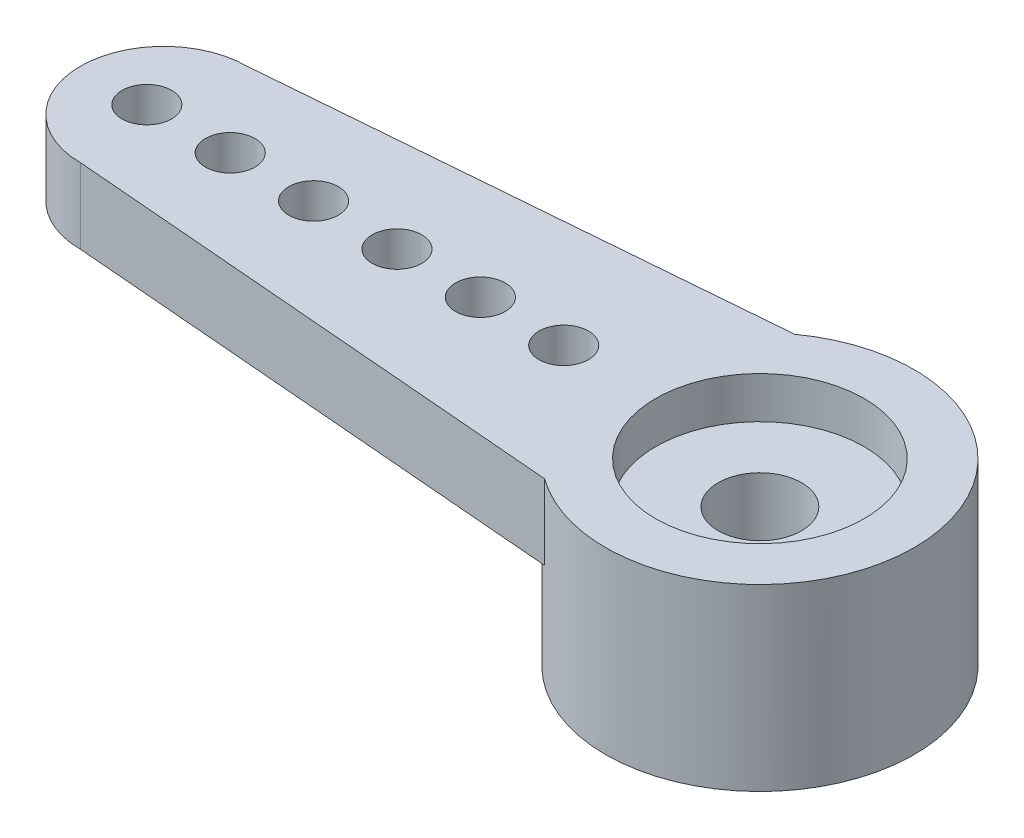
ISO-10303-21;
HEADER;
FILE_DESCRIPTION(('STEP AP214'),'2;1');
FILE_NAME('part.step','',(''),(''),'','','');
FILE_SCHEMA(('AUTOMOTIVE_DESIGN { 1 0 10303 214 1 1 1 1 }'));
ENDSEC;
DATA;
#1=APPLICATION_CONTEXT('core data for automotive mechanical design processes');
#2=APPLICATION_PROTOCOL_DEFINITION('international standard','automotive_design',2000,#1);
#3=PRODUCT_CONTEXT('',#1,'mechanical');
#4=PRODUCT('Part','Part','',(#3));
#5=PRODUCT_RELATED_PRODUCT_CATEGORY('part','',(#4));
#6=PRODUCT_DEFINITION_FORMATION('','',#4);
#7=PRODUCT_DEFINITION_CONTEXT('part definition',#1,'design');
#8=PRODUCT_DEFINITION('design','',#6,#7);
#9=PRODUCT_DEFINITION_SHAPE('','',#8);
#10=(LENGTH_UNIT() NAMED_UNIT(*) SI_UNIT(.MILLI.,.METRE.));
#11=(NAMED_UNIT(*) PLANE_ANGLE_UNIT() SI_UNIT($,.RADIAN.));
#12=(NAMED_UNIT(*) SI_UNIT($,.STERADIAN.) SOLID_ANGLE_UNIT());
#13=UNCERTAINTY_MEASURE_WITH_UNIT(LENGTH_MEASURE(1.E-05),#10,'distance_accuracy_value','');
#14=(GEOMETRIC_REPRESENTATION_CONTEXT(3) GLOBAL_UNCERTAINTY_ASSIGNED_CONTEXT((#13)) GLOBAL_UNIT_ASSIGNED_CONTEXT((#10,
#11,#12)) REPRESENTATION_CONTEXT('',''));
#15=CARTESIAN_POINT('',(0.,0.,0.));
#16=DIRECTION('',(0.,0.,1.));
#17=DIRECTION('',(1.,0.,0.));
#18=AXIS2_PLACEMENT_3D('',#15,#16,#17);
#19=CARTESIAN_POINT('',(0.,4.3,0.));
#20=DIRECTION('',(0.,-1.,0.));
#21=DIRECTION('',(0.,0.,-1.));
#22=AXIS2_PLACEMENT_3D('',#19,#20,#21);
#23=CYLINDRICAL_SURFACE('',#22,3.7);
#24=CARTESIAN_POINT('',(0.,2.5,0.));
#25=DIRECTION('',(0.,1.,0.));
#26=DIRECTION('',(0.,0.,1.));
#27=AXIS2_PLACEMENT_3D('',#24,#25,#26);
#28=CIRCLE('',#27,3.7);
#29=CARTESIAN_POINT('',(-2.16564,2.5,-3.00000056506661));
#30=VERTEX_POINT('',#29);
#31=CARTESIAN_POINT('',(-2.16564,2.5,3.00000056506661));
#32=VERTEX_POINT('',#31);
#33=EDGE_CURVE('E11',#30,#32,#28,.T.);
#34=ORIENTED_EDGE('',*,*,#33,.F.);
#35=DIRECTION('',(0.,1.,0.));
#36=VECTOR('',#35,1.);
#37=CARTESIAN_POINT('',(-2.16564,2.5,-3.00000056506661));
#38=LINE('',#37,#36);
#39=CARTESIAN_POINT('',(-2.16564,4.3,-3.00000056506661));
#40=VERTEX_POINT('',#39);
#41=EDGE_CURVE('E56',#30,#40,#38,.T.);
#42=ORIENTED_EDGE('',*,*,#41,.T.);
#43=CARTESIAN_POINT('',(0.,4.3,0.));
#44=DIRECTION('',(0.,1.,0.));
#45=DIRECTION('',(0.,0.,1.));
#46=AXIS2_PLACEMENT_3D('',#43,#44,#45);
#47=CIRCLE('',#46,3.7);
#48=CARTESIAN_POINT('',(-2.16564,4.3,3.00000056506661));
#49=VERTEX_POINT('',#48);
#50=EDGE_CURVE('E40',#49,#40,#47,.T.);
#51=ORIENTED_EDGE('',*,*,#50,.F.);
#52=DIRECTION('',(0.,1.,0.));
#53=VECTOR('',#52,1.);
#54=CARTESIAN_POINT('',(-2.16564,2.5,3.00000056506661));
#55=LINE('',#54,#53);
#56=EDGE_CURVE('E86',#32,#49,#55,.T.);
#57=ORIENTED_EDGE('',*,*,#56,.F.);
#58=EDGE_LOOP('',(#34,#42,#51,#57));
#59=FACE_BOUND('',#58,.T.);
#60=CARTESIAN_POINT('',(0.,0.,0.));
#61=DIRECTION('',(0.,1.,0.));
#62=DIRECTION('',(0.,0.,1.));
#63=AXIS2_PLACEMENT_3D('',#60,#61,#62);
#64=CIRCLE('',#63,3.7);
#65=CARTESIAN_POINT('',(0.,0.,3.7));
#66=VERTEX_POINT('',#65);
#67=EDGE_CURVE('E123',#66,#66,#64,.T.);
#68=ORIENTED_EDGE('',*,*,#67,.T.);
#69=EDGE_LOOP('',(#68));
#70=FACE_BOUND('',#69,.T.);
#71=ADVANCED_FACE('F33',(#59,#70),#23,.T.);
#72=CARTESIAN_POINT('',(0.,4.3,0.));
#73=DIRECTION('',(0.,1.,0.));
#74=DIRECTION('',(0.,0.,1.));
#75=AXIS2_PLACEMENT_3D('',#72,#73,#74);
#76=PLANE('',#75);
#77=CARTESIAN_POINT('',(-12.705,4.3,0.));
#78=DIRECTION('',(0.,1.,0.));
#79=DIRECTION('',(0.,0.,1.));
#80=AXIS2_PLACEMENT_3D('',#77,#78,#79);
#81=CIRCLE('',#80,0.595);
#82=CARTESIAN_POINT('',(-12.705,4.3,0.595000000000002));
#83=VERTEX_POINT('',#82);
#84=EDGE_CURVE('E213',#83,#83,#81,.T.);
#85=ORIENTED_EDGE('',*,*,#84,.F.);
#86=EDGE_LOOP('',(#85));
#87=FACE_BOUND('',#86,.T.);
#88=CARTESIAN_POINT('',(-10.705,4.3,0.));
#89=DIRECTION('',(0.,1.,0.));
#90=DIRECTION('',(0.,0.,1.));
#91=AXIS2_PLACEMENT_3D('',#88,#89,#90);
#92=CIRCLE('',#91,0.595);
#93=CARTESIAN_POINT('',(-10.705,4.3,0.595000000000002));
#94=VERTEX_POINT('',#93);
#95=EDGE_CURVE('E219',#94,#94,#92,.T.);
#96=ORIENTED_EDGE('',*,*,#95,.F.);
#97=EDGE_LOOP('',(#96));
#98=FACE_BOUND('',#97,.T.);
#99=CARTESIAN_POINT('',(-8.705,4.3,0.));
#100=DIRECTION('',(0.,1.,0.));
#101=DIRECTION('',(0.,0.,1.));
#102=AXIS2_PLACEMENT_3D('',#99,#100,#101);
#103=CIRCLE('',#102,0.595);
#104=CARTESIAN_POINT('',(-8.705,4.3,0.595000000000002));
#105=VERTEX_POINT('',#104);
#106=EDGE_CURVE('E227',#105,#105,#103,.T.);
#107=ORIENTED_EDGE('',*,*,#106,.F.);
#108=EDGE_LOOP('',(#107));
#109=FACE_BOUND('',#108,.T.);
#110=CARTESIAN_POINT('',(-6.705,4.3,0.));
#111=DIRECTION('',(0.,1.,0.));
#112=DIRECTION('',(0.,0.,1.));
#113=AXIS2_PLACEMENT_3D('',#110,#111,#112);
#114=CIRCLE('',#113,0.595);
#115=CARTESIAN_POINT('',(-6.705,4.3,0.595000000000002));
#116=VERTEX_POINT('',#115);
#117=EDGE_CURVE('E233',#116,#116,#114,.T.);
#118=ORIENTED_EDGE('',*,*,#117,.F.);
#119=EDGE_LOOP('',(#118));
#120=FACE_BOUND('',#119,.T.);
#121=CARTESIAN_POINT('',(-4.705,4.3,0.));
#122=DIRECTION('',(0.,1.,0.));
#123=DIRECTION('',(0.,0.,1.));
#124=AXIS2_PLACEMENT_3D('',#121,#122,#123);
#125=CIRCLE('',#124,0.595);
#126=CARTESIAN_POINT('',(-4.705,4.3,0.595000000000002));
#127=VERTEX_POINT('',#126);
#128=EDGE_CURVE('E239',#127,#127,#125,.T.);
#129=ORIENTED_EDGE('',*,*,#128,.F.);
#130=EDGE_LOOP('',(#129));
#131=FACE_BOUND('',#130,.T.);
#132=CARTESIAN_POINT('',(-14.705,4.3,0.));
#133=DIRECTION('',(0.,1.,0.));
#134=DIRECTION('',(0.,0.,1.));
#135=AXIS2_PLACEMENT_3D('',#132,#133,#134);
#136=CIRCLE('',#135,0.595);
#137=CARTESIAN_POINT('',(-14.705,4.3,0.595000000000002));
#138=VERTEX_POINT('',#137);
#139=EDGE_CURVE('E216',#138,#138,#136,.T.);
#140=ORIENTED_EDGE('',*,*,#139,.F.);
#141=EDGE_LOOP('',(#140));
#142=FACE_BOUND('',#141,.T.);
#143=ORIENTED_EDGE('',*,*,#50,.T.);
#144=DIRECTION('',(-0.996621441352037,0.,0.0821322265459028));
#145=VECTOR('',#144,1.);
#146=CARTESIAN_POINT('',(-2.16564,4.3,-3.00000056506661));
#147=LINE('',#146,#145);
#148=CARTESIAN_POINT('',(-14.3,4.3,-2.));
#149=VERTEX_POINT('',#148);
#150=EDGE_CURVE('E70',#40,#149,#147,.T.);
#151=ORIENTED_EDGE('',*,*,#150,.T.);
#152=CARTESIAN_POINT('',(-14.3,4.3,0.));
#153=DIRECTION('',(0.,1.,0.));
#154=DIRECTION('',(0.,0.,1.));
#155=AXIS2_PLACEMENT_3D('',#152,#153,#154);
#156=CIRCLE('',#155,2.);
#157=CARTESIAN_POINT('',(-14.3,4.3,2.));
#158=VERTEX_POINT('',#157);
#159=EDGE_CURVE('E100',#149,#158,#156,.T.);
#160=ORIENTED_EDGE('',*,*,#159,.T.);
#161=DIRECTION('',(0.996621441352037,0.,0.0821322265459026));
#162=VECTOR('',#161,1.);
#163=CARTESIAN_POINT('',(-2.16564,4.3,3.00000056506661));
#164=LINE('',#163,#162);
#165=EDGE_CURVE('E47',#158,#49,#164,.T.);
#166=ORIENTED_EDGE('',*,*,#165,.T.);
#167=EDGE_LOOP('',(#143,#151,#160,#166));
#168=FACE_BOUND('',#167,.T.);
#169=CARTESIAN_POINT('',(0.,4.3,0.));
#170=DIRECTION('',(0.,1.,0.));
#171=DIRECTION('',(0.,0.,1.));
#172=AXIS2_PLACEMENT_3D('',#169,#170,#171);
#173=CIRCLE('',#172,2.5);
#174=CARTESIAN_POINT('',(0.,4.3,2.5));
#175=VERTEX_POINT('',#174);
#176=EDGE_CURVE('E111',#175,#175,#173,.T.);
#177=ORIENTED_EDGE('',*,*,#176,.F.);
#178=EDGE_LOOP('',(#177));
#179=FACE_BOUND('',#178,.T.);
#180=ADVANCED_FACE('F133',(#87,#98,#109,#120,#131,#142,#168,#179),#76,.T.);
#181=CARTESIAN_POINT('',(0.,0.,0.));
#182=DIRECTION('',(0.,1.,0.));
#183=DIRECTION('',(0.,0.,1.));
#184=AXIS2_PLACEMENT_3D('',#181,#182,#183);
#185=PLANE('',#184);
#186=CARTESIAN_POINT('',(0.,0.,0.));
#187=DIRECTION('',(0.,-1.,0.));
#188=DIRECTION('',(0.,0.,-1.));
#189=AXIS2_PLACEMENT_3D('',#186,#187,#188);
#190=CIRCLE('',#189,2.5);
#191=CARTESIAN_POINT('',(0.,0.,-2.5));
#192=VERTEX_POINT('',#191);
#193=EDGE_CURVE('E117',#192,#192,#190,.T.);
#194=ORIENTED_EDGE('',*,*,#193,.F.);
#195=EDGE_LOOP('',(#194));
#196=FACE_BOUND('',#195,.T.);
#197=ORIENTED_EDGE('',*,*,#67,.F.);
#198=EDGE_LOOP('',(#197));
#199=FACE_BOUND('',#198,.T.);
#200=ADVANCED_FACE('F130',(#196,#199),#185,.F.);
#201=CARTESIAN_POINT('',(0.,1.5,0.));
#202=DIRECTION('',(0.,-1.,0.));
#203=DIRECTION('',(0.,0.,-1.));
#204=AXIS2_PLACEMENT_3D('',#201,#202,#203);
#205=CYLINDRICAL_SURFACE('',#204,2.5);
#206=CARTESIAN_POINT('',(0.,1.5,0.));
#207=DIRECTION('',(0.,-1.,0.));
#208=DIRECTION('',(0.,0.,-1.));
#209=AXIS2_PLACEMENT_3D('',#206,#207,#208);
#210=CIRCLE('',#209,2.5);
#211=CARTESIAN_POINT('',(0.,1.5,-2.5));
#212=VERTEX_POINT('',#211);
#213=EDGE_CURVE('E120',#212,#212,#210,.T.);
#214=ORIENTED_EDGE('',*,*,#213,.F.);
#215=EDGE_LOOP('',(#214));
#216=FACE_BOUND('',#215,.T.);
#217=ORIENTED_EDGE('',*,*,#193,.T.);
#218=EDGE_LOOP('',(#217));
#219=FACE_BOUND('',#218,.T.);
#220=ADVANCED_FACE('F132',(#216,#219),#205,.F.);
#221=CARTESIAN_POINT('',(0.,1.5,0.));
#222=DIRECTION('',(0.,-1.,0.));
#223=DIRECTION('',(0.,0.,-1.));
#224=AXIS2_PLACEMENT_3D('',#221,#222,#223);
#225=PLANE('',#224);
#226=CARTESIAN_POINT('',(0.,1.5,0.));
#227=DIRECTION('',(0.,1.,0.));
#228=DIRECTION('',(0.,0.,1.));
#229=AXIS2_PLACEMENT_3D('',#226,#227,#228);
#230=CIRCLE('',#229,1.);
#231=CARTESIAN_POINT('',(0.,1.5,1.));
#232=VERTEX_POINT('',#231);
#233=EDGE_CURVE('E108',#232,#232,#230,.T.);
#234=ORIENTED_EDGE('',*,*,#233,.T.);
#235=EDGE_LOOP('',(#234));
#236=FACE_BOUND('',#235,.T.);
#237=ORIENTED_EDGE('',*,*,#213,.T.);
#238=EDGE_LOOP('',(#237));
#239=FACE_BOUND('',#238,.T.);
#240=ADVANCED_FACE('F139',(#236,#239),#225,.T.);
#241=CARTESIAN_POINT('',(0.,3.3,0.));
#242=DIRECTION('',(0.,1.,0.));
#243=DIRECTION('',(0.,0.,1.));
#244=AXIS2_PLACEMENT_3D('',#241,#242,#243);
#245=CYLINDRICAL_SURFACE('',#244,2.5);
#246=CARTESIAN_POINT('',(0.,3.3,0.));
#247=DIRECTION('',(0.,1.,0.));
#248=DIRECTION('',(0.,0.,1.));
#249=AXIS2_PLACEMENT_3D('',#246,#247,#248);
#250=CIRCLE('',#249,2.5);
#251=CARTESIAN_POINT('',(0.,3.3,2.5));
#252=VERTEX_POINT('',#251);
#253=EDGE_CURVE('E114',#252,#252,#250,.T.);
#254=ORIENTED_EDGE('',*,*,#253,.F.);
#255=EDGE_LOOP('',(#254));
#256=FACE_BOUND('',#255,.T.);
#257=ORIENTED_EDGE('',*,*,#176,.T.);
#258=EDGE_LOOP('',(#257));
#259=FACE_BOUND('',#258,.T.);
#260=ADVANCED_FACE('F153',(#256,#259),#245,.F.);
#261=CARTESIAN_POINT('',(0.,3.3,0.));
#262=DIRECTION('',(0.,1.,0.));
#263=DIRECTION('',(0.,0.,1.));
#264=AXIS2_PLACEMENT_3D('',#261,#262,#263);
#265=PLANE('',#264);
#266=CARTESIAN_POINT('',(0.,3.3,0.));
#267=DIRECTION('',(0.,1.,0.));
#268=DIRECTION('',(0.,0.,1.));
#269=AXIS2_PLACEMENT_3D('',#266,#267,#268);
#270=CIRCLE('',#269,1.);
#271=CARTESIAN_POINT('',(0.,3.3,1.));
#272=VERTEX_POINT('',#271);
#273=EDGE_CURVE('E105',#272,#272,#270,.T.);
#274=ORIENTED_EDGE('',*,*,#273,.F.);
#275=EDGE_LOOP('',(#274));
#276=FACE_BOUND('',#275,.T.);
#277=ORIENTED_EDGE('',*,*,#253,.T.);
#278=EDGE_LOOP('',(#277));
#279=FACE_BOUND('',#278,.T.);
#280=ADVANCED_FACE('F155',(#276,#279),#265,.T.);
#281=CARTESIAN_POINT('',(0.,1.5,0.));
#282=DIRECTION('',(0.,1.,0.));
#283=DIRECTION('',(0.,0.,1.));
#284=AXIS2_PLACEMENT_3D('',#281,#282,#283);
#285=CYLINDRICAL_SURFACE('',#284,1.);
#286=ORIENTED_EDGE('',*,*,#233,.F.);
#287=EDGE_LOOP('',(#286));
#288=FACE_BOUND('',#287,.T.);
#289=ORIENTED_EDGE('',*,*,#273,.T.);
#290=EDGE_LOOP('',(#289));
#291=FACE_BOUND('',#290,.T.);
#292=ADVANCED_FACE('F162',(#288,#291),#285,.F.);
#293=CARTESIAN_POINT('',(-2.16564,2.5,-3.00000056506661));
#294=DIRECTION('',(-0.0821322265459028,0.,-0.996621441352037));
#295=DIRECTION('',(-0.996621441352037,0.,0.0821322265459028));
#296=AXIS2_PLACEMENT_3D('',#293,#294,#295);
#297=PLANE('',#296);
#298=ORIENTED_EDGE('',*,*,#150,.F.);
#299=ORIENTED_EDGE('',*,*,#41,.F.);
#300=DIRECTION('',(-0.996621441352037,0.,0.0821322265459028));
#301=VECTOR('',#300,1.);
#302=CARTESIAN_POINT('',(-2.16564,2.5,-3.00000056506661));
#303=LINE('',#302,#301);
#304=CARTESIAN_POINT('',(-14.3,2.5,-2.));
#305=VERTEX_POINT('',#304);
#306=EDGE_CURVE('E94',#30,#305,#303,.T.);
#307=ORIENTED_EDGE('',*,*,#306,.T.);
#308=DIRECTION('',(0.,1.,0.));
#309=VECTOR('',#308,1.);
#310=CARTESIAN_POINT('',(-14.3,2.5,-2.));
#311=LINE('',#310,#309);
#312=EDGE_CURVE('E76',#305,#149,#311,.T.);
#313=ORIENTED_EDGE('',*,*,#312,.T.);
#314=EDGE_LOOP('',(#298,#299,#307,#313));
#315=FACE_BOUND('',#314,.T.);
#316=ADVANCED_FACE('F171',(#315),#297,.T.);
#317=CARTESIAN_POINT('',(-2.16564,2.5,3.00000056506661));
#318=DIRECTION('',(-0.0821322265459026,0.,0.996621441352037));
#319=DIRECTION('',(0.996621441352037,0.,0.0821322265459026));
#320=AXIS2_PLACEMENT_3D('',#317,#318,#319);
#321=PLANE('',#320);
#322=ORIENTED_EDGE('',*,*,#165,.F.);
#323=DIRECTION('',(0.,1.,0.));
#324=VECTOR('',#323,1.);
#325=CARTESIAN_POINT('',(-14.3,2.5,2.));
#326=LINE('',#325,#324);
#327=CARTESIAN_POINT('',(-14.3,2.5,2.));
#328=VERTEX_POINT('',#327);
#329=EDGE_CURVE('E81',#328,#158,#326,.T.);
#330=ORIENTED_EDGE('',*,*,#329,.F.);
#331=DIRECTION('',(0.996621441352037,0.,0.0821322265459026));
#332=VECTOR('',#331,1.);
#333=CARTESIAN_POINT('',(-2.16564,2.5,3.00000056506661));
#334=LINE('',#333,#332);
#335=EDGE_CURVE('E84',#328,#32,#334,.T.);
#336=ORIENTED_EDGE('',*,*,#335,.T.);
#337=ORIENTED_EDGE('',*,*,#56,.T.);
#338=EDGE_LOOP('',(#322,#330,#336,#337));
#339=FACE_BOUND('',#338,.T.);
#340=ADVANCED_FACE('F83',(#339),#321,.T.);
#341=CARTESIAN_POINT('',(-14.3,2.5,0.));
#342=DIRECTION('',(0.,1.,0.));
#343=DIRECTION('',(0.,0.,1.));
#344=AXIS2_PLACEMENT_3D('',#341,#342,#343);
#345=CYLINDRICAL_SURFACE('',#344,2.);
#346=ORIENTED_EDGE('',*,*,#159,.F.);
#347=ORIENTED_EDGE('',*,*,#312,.F.);
#348=CARTESIAN_POINT('',(-14.3,2.5,0.));
#349=DIRECTION('',(0.,1.,0.));
#350=DIRECTION('',(0.,0.,1.));
#351=AXIS2_PLACEMENT_3D('',#348,#349,#350);
#352=CIRCLE('',#351,2.);
#353=EDGE_CURVE('E90',#305,#328,#352,.T.);
#354=ORIENTED_EDGE('',*,*,#353,.T.);
#355=ORIENTED_EDGE('',*,*,#329,.T.);
#356=EDGE_LOOP('',(#346,#347,#354,#355));
#357=FACE_BOUND('',#356,.T.);
#358=ADVANCED_FACE('F93',(#357),#345,.T.);
#359=CARTESIAN_POINT('',(-14.3,2.5,0.));
#360=DIRECTION('',(0.,1.,0.));
#361=DIRECTION('',(0.,0.,1.));
#362=AXIS2_PLACEMENT_3D('',#359,#360,#361);
#363=PLANE('',#362);
#364=CARTESIAN_POINT('',(-12.705,2.5,0.));
#365=DIRECTION('',(0.,1.,0.));
#366=DIRECTION('',(0.,0.,1.));
#367=AXIS2_PLACEMENT_3D('',#364,#365,#366);
#368=CIRCLE('',#367,0.595);
#369=CARTESIAN_POINT('',(-12.705,2.5,0.595000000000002));
#370=VERTEX_POINT('',#369);
#371=EDGE_CURVE('E210',#370,#370,#368,.T.);
#372=ORIENTED_EDGE('',*,*,#371,.T.);
#373=EDGE_LOOP('',(#372));
#374=FACE_BOUND('',#373,.T.);
#375=CARTESIAN_POINT('',(-10.705,2.5,0.));
#376=DIRECTION('',(0.,1.,0.));
#377=DIRECTION('',(0.,0.,1.));
#378=AXIS2_PLACEMENT_3D('',#375,#376,#377);
#379=CIRCLE('',#378,0.595);
#380=CARTESIAN_POINT('',(-10.705,2.5,0.595000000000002));
#381=VERTEX_POINT('',#380);
#382=EDGE_CURVE('E214',#381,#381,#379,.T.);
#383=ORIENTED_EDGE('',*,*,#382,.T.);
#384=EDGE_LOOP('',(#383));
#385=FACE_BOUND('',#384,.T.);
#386=CARTESIAN_POINT('',(-8.705,2.5,0.));
#387=DIRECTION('',(0.,1.,0.));
#388=DIRECTION('',(0.,0.,1.));
#389=AXIS2_PLACEMENT_3D('',#386,#387,#388);
#390=CIRCLE('',#389,0.595);
#391=CARTESIAN_POINT('',(-8.705,2.5,0.595000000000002));
#392=VERTEX_POINT('',#391);
#393=EDGE_CURVE('E224',#392,#392,#390,.T.);
#394=ORIENTED_EDGE('',*,*,#393,.T.);
#395=EDGE_LOOP('',(#394));
#396=FACE_BOUND('',#395,.T.);
#397=CARTESIAN_POINT('',(-6.705,2.5,0.));
#398=DIRECTION('',(0.,1.,0.));
#399=DIRECTION('',(0.,0.,1.));
#400=AXIS2_PLACEMENT_3D('',#397,#398,#399);
#401=CIRCLE('',#400,0.595);
#402=CARTESIAN_POINT('',(-6.705,2.5,0.595000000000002));
#403=VERTEX_POINT('',#402);
#404=EDGE_CURVE('E230',#403,#403,#401,.T.);
#405=ORIENTED_EDGE('',*,*,#404,.T.);
#406=EDGE_LOOP('',(#405));
#407=FACE_BOUND('',#406,.T.);
#408=CARTESIAN_POINT('',(-4.705,2.5,0.));
#409=DIRECTION('',(0.,1.,0.));
#410=DIRECTION('',(0.,0.,1.));
#411=AXIS2_PLACEMENT_3D('',#408,#409,#410);
#412=CIRCLE('',#411,0.595);
#413=CARTESIAN_POINT('',(-4.705,2.5,0.595000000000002));
#414=VERTEX_POINT('',#413);
#415=EDGE_CURVE('E236',#414,#414,#412,.T.);
#416=ORIENTED_EDGE('',*,*,#415,.T.);
#417=EDGE_LOOP('',(#416));
#418=FACE_BOUND('',#417,.T.);
#419=CARTESIAN_POINT('',(-14.705,2.5,0.));
#420=DIRECTION('',(0.,1.,0.));
#421=DIRECTION('',(0.,0.,1.));
#422=AXIS2_PLACEMENT_3D('',#419,#420,#421);
#423=CIRCLE('',#422,0.595);
#424=CARTESIAN_POINT('',(-14.705,2.5,0.595000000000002));
#425=VERTEX_POINT('',#424);
#426=EDGE_CURVE('E101',#425,#425,#423,.T.);
#427=ORIENTED_EDGE('',*,*,#426,.T.);
#428=EDGE_LOOP('',(#427));
#429=FACE_BOUND('',#428,.T.);
#430=ORIENTED_EDGE('',*,*,#306,.F.);
#431=ORIENTED_EDGE('',*,*,#33,.T.);
#432=ORIENTED_EDGE('',*,*,#335,.F.);
#433=ORIENTED_EDGE('',*,*,#353,.F.);
#434=EDGE_LOOP('',(#430,#431,#432,#433));
#435=FACE_BOUND('',#434,.T.);
#436=ADVANCED_FACE('F89',(#374,#385,#396,#407,#418,#429,#435),#363,.F.);
#437=CARTESIAN_POINT('',(-14.705,2.5,0.));
#438=DIRECTION('',(0.,1.,0.));
#439=DIRECTION('',(0.,0.,1.));
#440=AXIS2_PLACEMENT_3D('',#437,#438,#439);
#441=CYLINDRICAL_SURFACE('',#440,0.595);
#442=ORIENTED_EDGE('',*,*,#426,.F.);
#443=EDGE_LOOP('',(#442));
#444=FACE_BOUND('',#443,.T.);
#445=ORIENTED_EDGE('',*,*,#139,.T.);
#446=EDGE_LOOP('',(#445));
#447=FACE_BOUND('',#446,.T.);
#448=ADVANCED_FACE('F181',(#444,#447),#441,.F.);
#449=CARTESIAN_POINT('',(-4.705,2.5,0.));
#450=DIRECTION('',(0.,1.,0.));
#451=DIRECTION('',(0.,0.,1.));
#452=AXIS2_PLACEMENT_3D('',#449,#450,#451);
#453=CYLINDRICAL_SURFACE('',#452,0.595);
#454=ORIENTED_EDGE('',*,*,#415,.F.);
#455=EDGE_LOOP('',(#454));
#456=FACE_BOUND('',#455,.T.);
#457=ORIENTED_EDGE('',*,*,#128,.T.);
#458=EDGE_LOOP('',(#457));
#459=FACE_BOUND('',#458,.T.);
#460=ADVANCED_FACE('F185',(#456,#459),#453,.F.);
#461=CARTESIAN_POINT('',(-6.705,2.5,0.));
#462=DIRECTION('',(0.,1.,0.));
#463=DIRECTION('',(0.,0.,1.));
#464=AXIS2_PLACEMENT_3D('',#461,#462,#463);
#465=CYLINDRICAL_SURFACE('',#464,0.595);
#466=ORIENTED_EDGE('',*,*,#404,.F.);
#467=EDGE_LOOP('',(#466));
#468=FACE_BOUND('',#467,.T.);
#469=ORIENTED_EDGE('',*,*,#117,.T.);
#470=EDGE_LOOP('',(#469));
#471=FACE_BOUND('',#470,.T.);
#472=ADVANCED_FACE('F189',(#468,#471),#465,.F.);
#473=CARTESIAN_POINT('',(-8.705,2.5,0.));
#474=DIRECTION('',(0.,1.,0.));
#475=DIRECTION('',(0.,0.,1.));
#476=AXIS2_PLACEMENT_3D('',#473,#474,#475);
#477=CYLINDRICAL_SURFACE('',#476,0.595);
#478=ORIENTED_EDGE('',*,*,#393,.F.);
#479=EDGE_LOOP('',(#478));
#480=FACE_BOUND('',#479,.T.);
#481=ORIENTED_EDGE('',*,*,#106,.T.);
#482=EDGE_LOOP('',(#481));
#483=FACE_BOUND('',#482,.T.);
#484=ADVANCED_FACE('F193',(#480,#483),#477,.F.);
#485=CARTESIAN_POINT('',(-10.705,2.5,0.));
#486=DIRECTION('',(0.,1.,0.));
#487=DIRECTION('',(0.,0.,1.));
#488=AXIS2_PLACEMENT_3D('',#485,#486,#487);
#489=CYLINDRICAL_SURFACE('',#488,0.595);
#490=ORIENTED_EDGE('',*,*,#382,.F.);
#491=EDGE_LOOP('',(#490));
#492=FACE_BOUND('',#491,.T.);
#493=ORIENTED_EDGE('',*,*,#95,.T.);
#494=EDGE_LOOP('',(#493));
#495=FACE_BOUND('',#494,.T.);
#496=ADVANCED_FACE('F197',(#492,#495),#489,.F.);
#497=CARTESIAN_POINT('',(-12.705,2.5,0.));
#498=DIRECTION('',(0.,1.,0.));
#499=DIRECTION('',(0.,0.,1.));
#500=AXIS2_PLACEMENT_3D('',#497,#498,#499);
#501=CYLINDRICAL_SURFACE('',#500,0.595);
#502=ORIENTED_EDGE('',*,*,#371,.F.);
#503=EDGE_LOOP('',(#502));
#504=FACE_BOUND('',#503,.T.);
#505=ORIENTED_EDGE('',*,*,#84,.T.);
#506=EDGE_LOOP('',(#505));
#507=FACE_BOUND('',#506,.T.);
#508=ADVANCED_FACE('F201',(#504,#507),#501,.F.);
#509=CLOSED_SHELL('',(#71,#180,#200,#220,#240,#260,#280,#292,#316,#340,#358,#436,#448,#460,#472,
#484,#496,#508));
#510=MANIFOLD_SOLID_BREP('B2',#509);
#511=ADVANCED_BREP_SHAPE_REPRESENTATION('',(#18,#510),#14);
#512=SHAPE_DEFINITION_REPRESENTATION(#9,#511);
ENDSEC;
END-ISO-10303-21;
